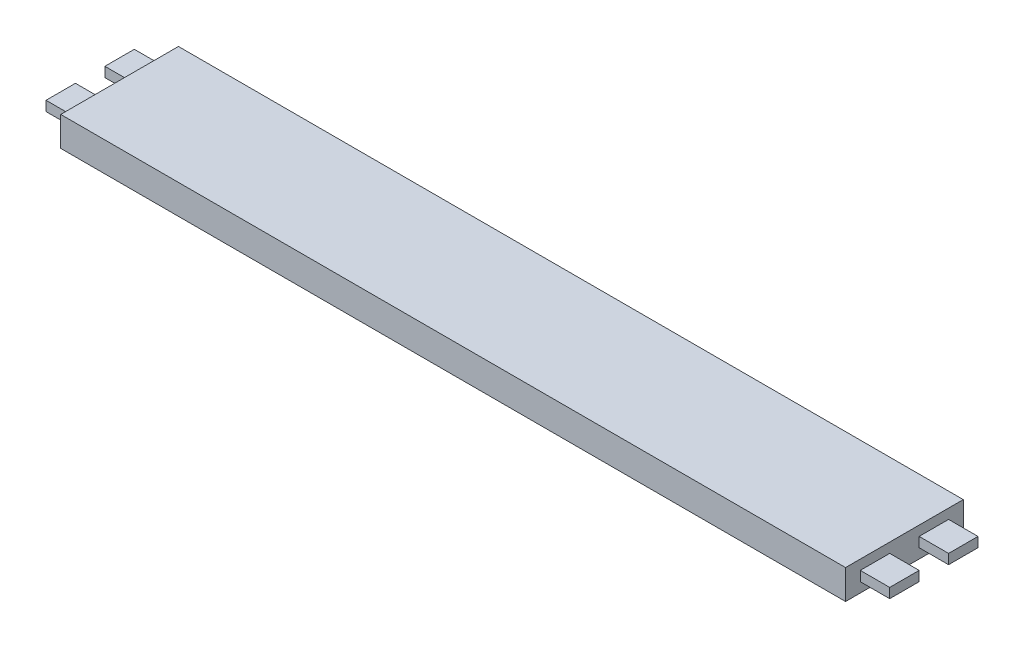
ISO-10303-21;
HEADER;
FILE_DESCRIPTION(('STEP AP214'),'2;1');
FILE_NAME('part.step','',(''),(''),'','','');
FILE_SCHEMA(('AUTOMOTIVE_DESIGN { 1 0 10303 214 1 1 1 1 }'));
ENDSEC;
DATA;
#1=APPLICATION_CONTEXT('core data for automotive mechanical design processes');
#2=APPLICATION_PROTOCOL_DEFINITION('international standard','automotive_design',2000,#1);
#3=PRODUCT_CONTEXT('',#1,'mechanical');
#4=PRODUCT('Part','Part','',(#3));
#5=PRODUCT_RELATED_PRODUCT_CATEGORY('part','',(#4));
#6=PRODUCT_DEFINITION_FORMATION('','',#4);
#7=PRODUCT_DEFINITION_CONTEXT('part definition',#1,'design');
#8=PRODUCT_DEFINITION('design','',#6,#7);
#9=PRODUCT_DEFINITION_SHAPE('','',#8);
#10=(LENGTH_UNIT() NAMED_UNIT(*) SI_UNIT(.MILLI.,.METRE.));
#11=(NAMED_UNIT(*) PLANE_ANGLE_UNIT() SI_UNIT($,.RADIAN.));
#12=(NAMED_UNIT(*) SI_UNIT($,.STERADIAN.) SOLID_ANGLE_UNIT());
#13=UNCERTAINTY_MEASURE_WITH_UNIT(LENGTH_MEASURE(1.E-05),#10,'distance_accuracy_value','');
#14=(GEOMETRIC_REPRESENTATION_CONTEXT(3) GLOBAL_UNCERTAINTY_ASSIGNED_CONTEXT((#13)) GLOBAL_UNIT_ASSIGNED_CONTEXT((#10,
#11,#12)) REPRESENTATION_CONTEXT('',''));
#15=CARTESIAN_POINT('',(0.,0.,0.));
#16=DIRECTION('',(0.,0.,1.));
#17=DIRECTION('',(1.,0.,0.));
#18=AXIS2_PLACEMENT_3D('',#15,#16,#17);
#19=CARTESIAN_POINT('',(200.,15.,0.));
#20=DIRECTION('',(-1.,0.,0.));
#21=DIRECTION('',(0.,0.,1.));
#22=AXIS2_PLACEMENT_3D('',#19,#20,#21);
#23=PLANE('',#22);
#24=DIRECTION('',(0.,-1.,0.));
#25=VECTOR('',#24,1.);
#26=CARTESIAN_POINT('',(200.,10.,-7.5));
#27=LINE('',#26,#25);
#28=CARTESIAN_POINT('',(200.,10.,-7.5));
#29=VERTEX_POINT('',#28);
#30=CARTESIAN_POINT('',(200.,5.00000000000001,-7.5));
#31=VERTEX_POINT('',#30);
#32=EDGE_CURVE('E325',#29,#31,#27,.T.);
#33=ORIENTED_EDGE('',*,*,#32,.F.);
#34=DIRECTION('',(0.,0.,1.));
#35=VECTOR('',#34,1.);
#36=CARTESIAN_POINT('',(200.,10.,-7.5));
#37=LINE('',#36,#35);
#38=CARTESIAN_POINT('',(200.,10.,-22.5));
#39=VERTEX_POINT('',#38);
#40=EDGE_CURVE('E342',#39,#29,#37,.T.);
#41=ORIENTED_EDGE('',*,*,#40,.F.);
#42=DIRECTION('',(0.,1.,0.));
#43=VECTOR('',#42,1.);
#44=CARTESIAN_POINT('',(200.,10.,-22.5));
#45=LINE('',#44,#43);
#46=CARTESIAN_POINT('',(200.,5.00000000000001,-22.5));
#47=VERTEX_POINT('',#46);
#48=EDGE_CURVE('E359',#47,#39,#45,.T.);
#49=ORIENTED_EDGE('',*,*,#48,.F.);
#50=DIRECTION('',(0.,0.,-1.));
#51=VECTOR('',#50,1.);
#52=CARTESIAN_POINT('',(200.,5.00000000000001,-7.5));
#53=LINE('',#52,#51);
#54=EDGE_CURVE('E355',#31,#47,#53,.T.);
#55=ORIENTED_EDGE('',*,*,#54,.F.);
#56=EDGE_LOOP('',(#33,#41,#49,#55));
#57=FACE_BOUND('',#56,.T.);
#58=DIRECTION('',(0.,0.,-1.));
#59=VECTOR('',#58,1.);
#60=CARTESIAN_POINT('',(200.,0.,0.));
#61=LINE('',#60,#59);
#62=CARTESIAN_POINT('',(200.,0.,0.));
#63=VERTEX_POINT('',#62);
#64=CARTESIAN_POINT('',(200.,0.,-60.));
#65=VERTEX_POINT('',#64);
#66=EDGE_CURVE('E394',#63,#65,#61,.T.);
#67=ORIENTED_EDGE('',*,*,#66,.T.);
#68=DIRECTION('',(0.,-1.,0.));
#69=VECTOR('',#68,1.);
#70=CARTESIAN_POINT('',(200.,15.,-60.));
#71=LINE('',#70,#69);
#72=CARTESIAN_POINT('',(200.,15.,-60.));
#73=VERTEX_POINT('',#72);
#74=EDGE_CURVE('E54',#73,#65,#71,.T.);
#75=ORIENTED_EDGE('',*,*,#74,.F.);
#76=DIRECTION('',(0.,0.,-1.));
#77=VECTOR('',#76,1.);
#78=CARTESIAN_POINT('',(200.,15.,0.));
#79=LINE('',#78,#77);
#80=CARTESIAN_POINT('',(200.,15.,0.));
#81=VERTEX_POINT('',#80);
#82=EDGE_CURVE('E385',#81,#73,#79,.T.);
#83=ORIENTED_EDGE('',*,*,#82,.F.);
#84=DIRECTION('',(0.,-1.,0.));
#85=VECTOR('',#84,1.);
#86=CARTESIAN_POINT('',(200.,15.,0.));
#87=LINE('',#86,#85);
#88=EDGE_CURVE('E11',#81,#63,#87,.T.);
#89=ORIENTED_EDGE('',*,*,#88,.T.);
#90=EDGE_LOOP('',(#67,#75,#83,#89));
#91=FACE_BOUND('',#90,.T.);
#92=DIRECTION('',(0.,-1.,0.));
#93=VECTOR('',#92,1.);
#94=CARTESIAN_POINT('',(200.,10.,-37.5));
#95=LINE('',#94,#93);
#96=CARTESIAN_POINT('',(200.,10.,-37.5));
#97=VERTEX_POINT('',#96);
#98=CARTESIAN_POINT('',(200.,5.,-37.5));
#99=VERTEX_POINT('',#98);
#100=EDGE_CURVE('E321',#97,#99,#95,.T.);
#101=ORIENTED_EDGE('',*,*,#100,.F.);
#102=DIRECTION('',(0.,0.,1.));
#103=VECTOR('',#102,1.);
#104=CARTESIAN_POINT('',(200.,10.,-37.5));
#105=LINE('',#104,#103);
#106=CARTESIAN_POINT('',(200.,10.,-52.5));
#107=VERTEX_POINT('',#106);
#108=EDGE_CURVE('E308',#107,#97,#105,.T.);
#109=ORIENTED_EDGE('',*,*,#108,.F.);
#110=DIRECTION('',(0.,1.,0.));
#111=VECTOR('',#110,1.);
#112=CARTESIAN_POINT('',(200.,10.,-52.5));
#113=LINE('',#112,#111);
#114=CARTESIAN_POINT('',(200.,5.,-52.5));
#115=VERTEX_POINT('',#114);
#116=EDGE_CURVE('E312',#115,#107,#113,.T.);
#117=ORIENTED_EDGE('',*,*,#116,.F.);
#118=DIRECTION('',(0.,0.,-1.));
#119=VECTOR('',#118,1.);
#120=CARTESIAN_POINT('',(200.,5.,-37.5));
#121=LINE('',#120,#119);
#122=EDGE_CURVE('E317',#99,#115,#121,.T.);
#123=ORIENTED_EDGE('',*,*,#122,.F.);
#124=EDGE_LOOP('',(#101,#109,#117,#123));
#125=FACE_BOUND('',#124,.T.);
#126=ADVANCED_FACE('F45',(#57,#91,#125),#23,.F.);
#127=CARTESIAN_POINT('',(0.,15.,0.));
#128=DIRECTION('',(0.,0.,-1.));
#129=DIRECTION('',(-1.,0.,0.));
#130=AXIS2_PLACEMENT_3D('',#127,#128,#129);
#131=PLANE('',#130);
#132=DIRECTION('',(1.,0.,0.));
#133=VECTOR('',#132,1.);
#134=CARTESIAN_POINT('',(0.,0.,0.));
#135=LINE('',#134,#133);
#136=CARTESIAN_POINT('',(-200.,0.,0.));
#137=VERTEX_POINT('',#136);
#138=EDGE_CURVE('E381',#137,#63,#135,.T.);
#139=ORIENTED_EDGE('',*,*,#138,.T.);
#140=ORIENTED_EDGE('',*,*,#88,.F.);
#141=DIRECTION('',(1.,0.,0.));
#142=VECTOR('',#141,1.);
#143=CARTESIAN_POINT('',(0.,15.,0.));
#144=LINE('',#143,#142);
#145=CARTESIAN_POINT('',(-200.,15.,0.));
#146=VERTEX_POINT('',#145);
#147=EDGE_CURVE('E382',#146,#81,#144,.T.);
#148=ORIENTED_EDGE('',*,*,#147,.F.);
#149=DIRECTION('',(0.,-1.,0.));
#150=VECTOR('',#149,1.);
#151=CARTESIAN_POINT('',(-200.,15.,0.));
#152=LINE('',#151,#150);
#153=EDGE_CURVE('E280',#146,#137,#152,.T.);
#154=ORIENTED_EDGE('',*,*,#153,.T.);
#155=EDGE_LOOP('',(#139,#140,#148,#154));
#156=FACE_BOUND('',#155,.T.);
#157=ADVANCED_FACE('F47',(#156),#131,.F.);
#158=CARTESIAN_POINT('',(0.,15.,-60.));
#159=DIRECTION('',(0.,0.,1.));
#160=DIRECTION('',(1.,0.,0.));
#161=AXIS2_PLACEMENT_3D('',#158,#159,#160);
#162=PLANE('',#161);
#163=DIRECTION('',(-1.,0.,0.));
#164=VECTOR('',#163,1.);
#165=CARTESIAN_POINT('',(0.,0.,-60.));
#166=LINE('',#165,#164);
#167=CARTESIAN_POINT('',(-200.,0.,-60.));
#168=VERTEX_POINT('',#167);
#169=EDGE_CURVE('E386',#65,#168,#166,.T.);
#170=ORIENTED_EDGE('',*,*,#169,.T.);
#171=DIRECTION('',(0.,-1.,0.));
#172=VECTOR('',#171,1.);
#173=CARTESIAN_POINT('',(-200.,15.,-60.));
#174=LINE('',#173,#172);
#175=CARTESIAN_POINT('',(-200.,15.,-60.));
#176=VERTEX_POINT('',#175);
#177=EDGE_CURVE('E287',#176,#168,#174,.T.);
#178=ORIENTED_EDGE('',*,*,#177,.F.);
#179=DIRECTION('',(-1.,0.,0.));
#180=VECTOR('',#179,1.);
#181=CARTESIAN_POINT('',(0.,15.,-60.));
#182=LINE('',#181,#180);
#183=EDGE_CURVE('E389',#73,#176,#182,.T.);
#184=ORIENTED_EDGE('',*,*,#183,.F.);
#185=ORIENTED_EDGE('',*,*,#74,.T.);
#186=EDGE_LOOP('',(#170,#178,#184,#185));
#187=FACE_BOUND('',#186,.T.);
#188=ADVANCED_FACE('F404',(#187),#162,.F.);
#189=CARTESIAN_POINT('',(0.,15.,0.));
#190=DIRECTION('',(0.,-1.,0.));
#191=DIRECTION('',(0.,0.,-1.));
#192=AXIS2_PLACEMENT_3D('',#189,#190,#191);
#193=PLANE('',#192);
#194=ORIENTED_EDGE('',*,*,#183,.T.);
#195=DIRECTION('',(0.,0.,-1.));
#196=VECTOR('',#195,1.);
#197=CARTESIAN_POINT('',(-200.,15.,0.));
#198=LINE('',#197,#196);
#199=EDGE_CURVE('E276',#146,#176,#198,.T.);
#200=ORIENTED_EDGE('',*,*,#199,.F.);
#201=ORIENTED_EDGE('',*,*,#147,.T.);
#202=ORIENTED_EDGE('',*,*,#82,.T.);
#203=EDGE_LOOP('',(#194,#200,#201,#202));
#204=FACE_BOUND('',#203,.T.);
#205=ADVANCED_FACE('F417',(#204),#193,.F.);
#206=CARTESIAN_POINT('',(0.,0.,0.));
#207=DIRECTION('',(0.,-1.,0.));
#208=DIRECTION('',(0.,0.,-1.));
#209=AXIS2_PLACEMENT_3D('',#206,#207,#208);
#210=PLANE('',#209);
#211=ORIENTED_EDGE('',*,*,#138,.F.);
#212=DIRECTION('',(0.,0.,-1.));
#213=VECTOR('',#212,1.);
#214=CARTESIAN_POINT('',(-200.,0.,0.));
#215=LINE('',#214,#213);
#216=EDGE_CURVE('E275',#137,#168,#215,.T.);
#217=ORIENTED_EDGE('',*,*,#216,.T.);
#218=ORIENTED_EDGE('',*,*,#169,.F.);
#219=ORIENTED_EDGE('',*,*,#66,.F.);
#220=EDGE_LOOP('',(#211,#217,#218,#219));
#221=FACE_BOUND('',#220,.T.);
#222=ADVANCED_FACE('F410',(#221),#210,.T.);
#223=CARTESIAN_POINT('',(215.,10.,-7.5));
#224=DIRECTION('',(0.,0.,-1.));
#225=DIRECTION('',(0.,1.,0.));
#226=AXIS2_PLACEMENT_3D('',#223,#224,#225);
#227=PLANE('',#226);
#228=ORIENTED_EDGE('',*,*,#32,.T.);
#229=DIRECTION('',(-1.,0.,0.));
#230=VECTOR('',#229,1.);
#231=CARTESIAN_POINT('',(215.,5.00000000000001,-7.5));
#232=LINE('',#231,#230);
#233=CARTESIAN_POINT('',(215.,5.00000000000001,-7.5));
#234=VERTEX_POINT('',#233);
#235=EDGE_CURVE('E377',#234,#31,#232,.T.);
#236=ORIENTED_EDGE('',*,*,#235,.F.);
#237=DIRECTION('',(0.,-1.,0.));
#238=VECTOR('',#237,1.);
#239=CARTESIAN_POINT('',(215.,10.,-7.5));
#240=LINE('',#239,#238);
#241=CARTESIAN_POINT('',(215.,10.,-7.5));
#242=VERTEX_POINT('',#241);
#243=EDGE_CURVE('E337',#242,#234,#240,.T.);
#244=ORIENTED_EDGE('',*,*,#243,.F.);
#245=DIRECTION('',(-1.,0.,0.));
#246=VECTOR('',#245,1.);
#247=CARTESIAN_POINT('',(215.,10.,-7.5));
#248=LINE('',#247,#246);
#249=EDGE_CURVE('E351',#242,#29,#248,.T.);
#250=ORIENTED_EDGE('',*,*,#249,.T.);
#251=EDGE_LOOP('',(#228,#236,#244,#250));
#252=FACE_BOUND('',#251,.T.);
#253=ADVANCED_FACE('F435',(#252),#227,.F.);
#254=CARTESIAN_POINT('',(215.,5.00000000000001,-7.5));
#255=DIRECTION('',(0.,1.,0.));
#256=DIRECTION('',(0.,0.,1.));
#257=AXIS2_PLACEMENT_3D('',#254,#255,#256);
#258=PLANE('',#257);
#259=ORIENTED_EDGE('',*,*,#54,.T.);
#260=DIRECTION('',(-1.,0.,0.));
#261=VECTOR('',#260,1.);
#262=CARTESIAN_POINT('',(215.,5.00000000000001,-22.5));
#263=LINE('',#262,#261);
#264=CARTESIAN_POINT('',(215.,5.00000000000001,-22.5));
#265=VERTEX_POINT('',#264);
#266=EDGE_CURVE('E373',#265,#47,#263,.T.);
#267=ORIENTED_EDGE('',*,*,#266,.F.);
#268=DIRECTION('',(0.,0.,-1.));
#269=VECTOR('',#268,1.);
#270=CARTESIAN_POINT('',(215.,5.00000000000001,-7.5));
#271=LINE('',#270,#269);
#272=EDGE_CURVE('E341',#234,#265,#271,.T.);
#273=ORIENTED_EDGE('',*,*,#272,.F.);
#274=ORIENTED_EDGE('',*,*,#235,.T.);
#275=EDGE_LOOP('',(#259,#267,#273,#274));
#276=FACE_BOUND('',#275,.T.);
#277=ADVANCED_FACE('F439',(#276),#258,.F.);
#278=CARTESIAN_POINT('',(215.,10.,-22.5));
#279=DIRECTION('',(0.,0.,1.));
#280=DIRECTION('',(1.,0.,0.));
#281=AXIS2_PLACEMENT_3D('',#278,#279,#280);
#282=PLANE('',#281);
#283=ORIENTED_EDGE('',*,*,#48,.T.);
#284=DIRECTION('',(-1.,0.,0.));
#285=VECTOR('',#284,1.);
#286=CARTESIAN_POINT('',(215.,10.,-22.5));
#287=LINE('',#286,#285);
#288=CARTESIAN_POINT('',(215.,10.,-22.5));
#289=VERTEX_POINT('',#288);
#290=EDGE_CURVE('E369',#289,#39,#287,.T.);
#291=ORIENTED_EDGE('',*,*,#290,.F.);
#292=DIRECTION('',(0.,1.,0.));
#293=VECTOR('',#292,1.);
#294=CARTESIAN_POINT('',(215.,10.,-22.5));
#295=LINE('',#294,#293);
#296=EDGE_CURVE('E345',#265,#289,#295,.T.);
#297=ORIENTED_EDGE('',*,*,#296,.F.);
#298=ORIENTED_EDGE('',*,*,#266,.T.);
#299=EDGE_LOOP('',(#283,#291,#297,#298));
#300=FACE_BOUND('',#299,.T.);
#301=ADVANCED_FACE('F443',(#300),#282,.F.);
#302=CARTESIAN_POINT('',(215.,10.,-7.5));
#303=DIRECTION('',(0.,-1.,0.));
#304=DIRECTION('',(0.,0.,-1.));
#305=AXIS2_PLACEMENT_3D('',#302,#303,#304);
#306=PLANE('',#305);
#307=ORIENTED_EDGE('',*,*,#40,.T.);
#308=ORIENTED_EDGE('',*,*,#249,.F.);
#309=DIRECTION('',(0.,0.,1.));
#310=VECTOR('',#309,1.);
#311=CARTESIAN_POINT('',(215.,10.,-7.5));
#312=LINE('',#311,#310);
#313=EDGE_CURVE('E348',#289,#242,#312,.T.);
#314=ORIENTED_EDGE('',*,*,#313,.F.);
#315=ORIENTED_EDGE('',*,*,#290,.T.);
#316=EDGE_LOOP('',(#307,#308,#314,#315));
#317=FACE_BOUND('',#316,.T.);
#318=ADVANCED_FACE('F447',(#317),#306,.F.);
#319=CARTESIAN_POINT('',(215.,0.,0.));
#320=DIRECTION('',(1.,0.,0.));
#321=DIRECTION('',(0.,0.,-1.));
#322=AXIS2_PLACEMENT_3D('',#319,#320,#321);
#323=PLANE('',#322);
#324=ORIENTED_EDGE('',*,*,#243,.T.);
#325=ORIENTED_EDGE('',*,*,#272,.T.);
#326=ORIENTED_EDGE('',*,*,#296,.T.);
#327=ORIENTED_EDGE('',*,*,#313,.T.);
#328=EDGE_LOOP('',(#324,#325,#326,#327));
#329=FACE_BOUND('',#328,.T.);
#330=ADVANCED_FACE('F451',(#329),#323,.T.);
#331=CARTESIAN_POINT('',(215.,10.,-37.5));
#332=DIRECTION('',(0.,0.,-1.));
#333=DIRECTION('',(-1.,0.,0.));
#334=AXIS2_PLACEMENT_3D('',#331,#332,#333);
#335=PLANE('',#334);
#336=ORIENTED_EDGE('',*,*,#100,.T.);
#337=DIRECTION('',(-1.,0.,0.));
#338=VECTOR('',#337,1.);
#339=CARTESIAN_POINT('',(215.,5.,-37.5));
#340=LINE('',#339,#338);
#341=CARTESIAN_POINT('',(215.,5.,-37.5));
#342=VERTEX_POINT('',#341);
#343=EDGE_CURVE('E291',#342,#99,#340,.T.);
#344=ORIENTED_EDGE('',*,*,#343,.F.);
#345=DIRECTION('',(0.,-1.,0.));
#346=VECTOR('',#345,1.);
#347=CARTESIAN_POINT('',(215.,10.,-37.5));
#348=LINE('',#347,#346);
#349=CARTESIAN_POINT('',(215.,10.,-37.5));
#350=VERTEX_POINT('',#349);
#351=EDGE_CURVE('E313',#350,#342,#348,.T.);
#352=ORIENTED_EDGE('',*,*,#351,.F.);
#353=DIRECTION('',(-1.,0.,0.));
#354=VECTOR('',#353,1.);
#355=CARTESIAN_POINT('',(215.,10.,-37.5));
#356=LINE('',#355,#354);
#357=EDGE_CURVE('E303',#350,#97,#356,.T.);
#358=ORIENTED_EDGE('',*,*,#357,.T.);
#359=EDGE_LOOP('',(#336,#344,#352,#358));
#360=FACE_BOUND('',#359,.T.);
#361=ADVANCED_FACE('F455',(#360),#335,.F.);
#362=CARTESIAN_POINT('',(215.,5.,-37.5));
#363=DIRECTION('',(0.,1.,0.));
#364=DIRECTION('',(0.,0.,1.));
#365=AXIS2_PLACEMENT_3D('',#362,#363,#364);
#366=PLANE('',#365);
#367=ORIENTED_EDGE('',*,*,#122,.T.);
#368=DIRECTION('',(-1.,0.,0.));
#369=VECTOR('',#368,1.);
#370=CARTESIAN_POINT('',(215.,5.,-52.5));
#371=LINE('',#370,#369);
#372=CARTESIAN_POINT('',(215.,5.,-52.5));
#373=VERTEX_POINT('',#372);
#374=EDGE_CURVE('E295',#373,#115,#371,.T.);
#375=ORIENTED_EDGE('',*,*,#374,.F.);
#376=DIRECTION('',(0.,0.,-1.));
#377=VECTOR('',#376,1.);
#378=CARTESIAN_POINT('',(215.,5.,-37.5));
#379=LINE('',#378,#377);
#380=EDGE_CURVE('E331',#342,#373,#379,.T.);
#381=ORIENTED_EDGE('',*,*,#380,.F.);
#382=ORIENTED_EDGE('',*,*,#343,.T.);
#383=EDGE_LOOP('',(#367,#375,#381,#382));
#384=FACE_BOUND('',#383,.T.);
#385=ADVANCED_FACE('F467',(#384),#366,.F.);
#386=CARTESIAN_POINT('',(215.,10.,-52.5));
#387=DIRECTION('',(0.,0.,1.));
#388=DIRECTION('',(1.,0.,0.));
#389=AXIS2_PLACEMENT_3D('',#386,#387,#388);
#390=PLANE('',#389);
#391=ORIENTED_EDGE('',*,*,#116,.T.);
#392=DIRECTION('',(-1.,0.,0.));
#393=VECTOR('',#392,1.);
#394=CARTESIAN_POINT('',(215.,10.,-52.5));
#395=LINE('',#394,#393);
#396=CARTESIAN_POINT('',(215.,10.,-52.5));
#397=VERTEX_POINT('',#396);
#398=EDGE_CURVE('E299',#397,#107,#395,.T.);
#399=ORIENTED_EDGE('',*,*,#398,.F.);
#400=DIRECTION('',(0.,1.,0.));
#401=VECTOR('',#400,1.);
#402=CARTESIAN_POINT('',(215.,10.,-52.5));
#403=LINE('',#402,#401);
#404=EDGE_CURVE('E328',#373,#397,#403,.T.);
#405=ORIENTED_EDGE('',*,*,#404,.F.);
#406=ORIENTED_EDGE('',*,*,#374,.T.);
#407=EDGE_LOOP('',(#391,#399,#405,#406));
#408=FACE_BOUND('',#407,.T.);
#409=ADVANCED_FACE('F463',(#408),#390,.F.);
#410=CARTESIAN_POINT('',(215.,10.,-37.5));
#411=DIRECTION('',(0.,-1.,0.));
#412=DIRECTION('',(0.,0.,-1.));
#413=AXIS2_PLACEMENT_3D('',#410,#411,#412);
#414=PLANE('',#413);
#415=ORIENTED_EDGE('',*,*,#108,.T.);
#416=ORIENTED_EDGE('',*,*,#357,.F.);
#417=DIRECTION('',(0.,0.,1.));
#418=VECTOR('',#417,1.);
#419=CARTESIAN_POINT('',(215.,10.,-37.5));
#420=LINE('',#419,#418);
#421=EDGE_CURVE('E307',#397,#350,#420,.T.);
#422=ORIENTED_EDGE('',*,*,#421,.F.);
#423=ORIENTED_EDGE('',*,*,#398,.T.);
#424=EDGE_LOOP('',(#415,#416,#422,#423));
#425=FACE_BOUND('',#424,.T.);
#426=ADVANCED_FACE('F459',(#425),#414,.F.);
#427=CARTESIAN_POINT('',(215.,0.,0.));
#428=DIRECTION('',(1.,0.,0.));
#429=DIRECTION('',(0.,0.,-1.));
#430=AXIS2_PLACEMENT_3D('',#427,#428,#429);
#431=PLANE('',#430);
#432=ORIENTED_EDGE('',*,*,#351,.T.);
#433=ORIENTED_EDGE('',*,*,#380,.T.);
#434=ORIENTED_EDGE('',*,*,#404,.T.);
#435=ORIENTED_EDGE('',*,*,#421,.T.);
#436=EDGE_LOOP('',(#432,#433,#434,#435));
#437=FACE_BOUND('',#436,.T.);
#438=ADVANCED_FACE('F457',(#437),#431,.T.);
#439=CARTESIAN_POINT('',(-200.,15.,0.));
#440=DIRECTION('',(-1.,0.,0.));
#441=DIRECTION('',(0.,0.,1.));
#442=AXIS2_PLACEMENT_3D('',#439,#440,#441);
#443=PLANE('',#442);
#444=DIRECTION('',(0.,-1.,0.));
#445=VECTOR('',#444,1.);
#446=CARTESIAN_POINT('',(-200.,10.,-37.5));
#447=LINE('',#446,#445);
#448=CARTESIAN_POINT('',(-200.,10.,-37.5));
#449=VERTEX_POINT('',#448);
#450=CARTESIAN_POINT('',(-200.,5.,-37.5));
#451=VERTEX_POINT('',#450);
#452=EDGE_CURVE('E188',#449,#451,#447,.T.);
#453=ORIENTED_EDGE('',*,*,#452,.T.);
#454=DIRECTION('',(0.,0.,-1.));
#455=VECTOR('',#454,1.);
#456=CARTESIAN_POINT('',(-200.,5.,-37.5));
#457=LINE('',#456,#455);
#458=CARTESIAN_POINT('',(-200.,5.,-52.5));
#459=VERTEX_POINT('',#458);
#460=EDGE_CURVE('E204',#451,#459,#457,.T.);
#461=ORIENTED_EDGE('',*,*,#460,.T.);
#462=DIRECTION('',(0.,1.,0.));
#463=VECTOR('',#462,1.);
#464=CARTESIAN_POINT('',(-200.,10.,-52.5));
#465=LINE('',#464,#463);
#466=CARTESIAN_POINT('',(-200.,10.,-52.5));
#467=VERTEX_POINT('',#466);
#468=EDGE_CURVE('E66',#459,#467,#465,.T.);
#469=ORIENTED_EDGE('',*,*,#468,.T.);
#470=DIRECTION('',(0.,0.,1.));
#471=VECTOR('',#470,1.);
#472=CARTESIAN_POINT('',(-200.,10.,-37.5));
#473=LINE('',#472,#471);
#474=EDGE_CURVE('E61',#467,#449,#473,.T.);
#475=ORIENTED_EDGE('',*,*,#474,.T.);
#476=EDGE_LOOP('',(#453,#461,#469,#475));
#477=FACE_BOUND('',#476,.T.);
#478=DIRECTION('',(0.,-1.,0.));
#479=VECTOR('',#478,1.);
#480=CARTESIAN_POINT('',(-200.,10.,-7.5));
#481=LINE('',#480,#479);
#482=CARTESIAN_POINT('',(-200.,10.,-7.5));
#483=VERTEX_POINT('',#482);
#484=CARTESIAN_POINT('',(-200.,5.00000000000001,-7.5));
#485=VERTEX_POINT('',#484);
#486=EDGE_CURVE('E192',#483,#485,#481,.T.);
#487=ORIENTED_EDGE('',*,*,#486,.T.);
#488=DIRECTION('',(0.,0.,-1.));
#489=VECTOR('',#488,1.);
#490=CARTESIAN_POINT('',(-200.,5.00000000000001,-7.5));
#491=LINE('',#490,#489);
#492=CARTESIAN_POINT('',(-200.,5.00000000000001,-22.5));
#493=VERTEX_POINT('',#492);
#494=EDGE_CURVE('E237',#485,#493,#491,.T.);
#495=ORIENTED_EDGE('',*,*,#494,.T.);
#496=DIRECTION('',(0.,1.,0.));
#497=VECTOR('',#496,1.);
#498=CARTESIAN_POINT('',(-200.,10.,-22.5));
#499=LINE('',#498,#497);
#500=CARTESIAN_POINT('',(-200.,10.,-22.5));
#501=VERTEX_POINT('',#500);
#502=EDGE_CURVE('E255',#493,#501,#499,.T.);
#503=ORIENTED_EDGE('',*,*,#502,.T.);
#504=DIRECTION('',(0.,0.,1.));
#505=VECTOR('',#504,1.);
#506=CARTESIAN_POINT('',(-200.,10.,-7.5));
#507=LINE('',#506,#505);
#508=EDGE_CURVE('E252',#501,#483,#507,.T.);
#509=ORIENTED_EDGE('',*,*,#508,.T.);
#510=EDGE_LOOP('',(#487,#495,#503,#509));
#511=FACE_BOUND('',#510,.T.);
#512=ORIENTED_EDGE('',*,*,#216,.F.);
#513=ORIENTED_EDGE('',*,*,#153,.F.);
#514=ORIENTED_EDGE('',*,*,#199,.T.);
#515=ORIENTED_EDGE('',*,*,#177,.T.);
#516=EDGE_LOOP('',(#512,#513,#514,#515));
#517=FACE_BOUND('',#516,.T.);
#518=ADVANCED_FACE('F414',(#477,#511,#517),#443,.T.);
#519=CARTESIAN_POINT('',(-215.,10.,-7.5));
#520=DIRECTION('',(0.,0.,1.));
#521=DIRECTION('',(0.,-1.,0.));
#522=AXIS2_PLACEMENT_3D('',#519,#520,#521);
#523=PLANE('',#522);
#524=ORIENTED_EDGE('',*,*,#486,.F.);
#525=DIRECTION('',(1.,0.,0.));
#526=VECTOR('',#525,1.);
#527=CARTESIAN_POINT('',(-215.,10.,-7.5));
#528=LINE('',#527,#526);
#529=CARTESIAN_POINT('',(-215.,10.,-7.5));
#530=VERTEX_POINT('',#529);
#531=EDGE_CURVE('E271',#530,#483,#528,.T.);
#532=ORIENTED_EDGE('',*,*,#531,.F.);
#533=DIRECTION('',(0.,-1.,0.));
#534=VECTOR('',#533,1.);
#535=CARTESIAN_POINT('',(-215.,10.,-7.5));
#536=LINE('',#535,#534);
#537=CARTESIAN_POINT('',(-215.,5.00000000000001,-7.5));
#538=VERTEX_POINT('',#537);
#539=EDGE_CURVE('E232',#530,#538,#536,.T.);
#540=ORIENTED_EDGE('',*,*,#539,.T.);
#541=DIRECTION('',(1.,0.,0.));
#542=VECTOR('',#541,1.);
#543=CARTESIAN_POINT('',(-215.,5.00000000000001,-7.5));
#544=LINE('',#543,#542);
#545=EDGE_CURVE('E249',#538,#485,#544,.T.);
#546=ORIENTED_EDGE('',*,*,#545,.T.);
#547=EDGE_LOOP('',(#524,#532,#540,#546));
#548=FACE_BOUND('',#547,.T.);
#549=ADVANCED_FACE('F477',(#548),#523,.T.);
#550=CARTESIAN_POINT('',(-215.,10.,-7.5));
#551=DIRECTION('',(0.,1.,0.));
#552=DIRECTION('',(0.,0.,1.));
#553=AXIS2_PLACEMENT_3D('',#550,#551,#552);
#554=PLANE('',#553);
#555=ORIENTED_EDGE('',*,*,#508,.F.);
#556=DIRECTION('',(1.,0.,0.));
#557=VECTOR('',#556,1.);
#558=CARTESIAN_POINT('',(-215.,10.,-22.5));
#559=LINE('',#558,#557);
#560=CARTESIAN_POINT('',(-215.,10.,-22.5));
#561=VERTEX_POINT('',#560);
#562=EDGE_CURVE('E267',#561,#501,#559,.T.);
#563=ORIENTED_EDGE('',*,*,#562,.F.);
#564=DIRECTION('',(0.,0.,1.));
#565=VECTOR('',#564,1.);
#566=CARTESIAN_POINT('',(-215.,10.,-7.5));
#567=LINE('',#566,#565);
#568=EDGE_CURVE('E236',#561,#530,#567,.T.);
#569=ORIENTED_EDGE('',*,*,#568,.T.);
#570=ORIENTED_EDGE('',*,*,#531,.T.);
#571=EDGE_LOOP('',(#555,#563,#569,#570));
#572=FACE_BOUND('',#571,.T.);
#573=ADVANCED_FACE('F480',(#572),#554,.T.);
#574=CARTESIAN_POINT('',(-215.,10.,-22.5));
#575=DIRECTION('',(0.,0.,-1.));
#576=DIRECTION('',(-1.,0.,0.));
#577=AXIS2_PLACEMENT_3D('',#574,#575,#576);
#578=PLANE('',#577);
#579=ORIENTED_EDGE('',*,*,#502,.F.);
#580=DIRECTION('',(1.,0.,0.));
#581=VECTOR('',#580,1.);
#582=CARTESIAN_POINT('',(-215.,5.00000000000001,-22.5));
#583=LINE('',#582,#581);
#584=CARTESIAN_POINT('',(-215.,5.00000000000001,-22.5));
#585=VERTEX_POINT('',#584);
#586=EDGE_CURVE('E263',#585,#493,#583,.T.);
#587=ORIENTED_EDGE('',*,*,#586,.F.);
#588=DIRECTION('',(0.,1.,0.));
#589=VECTOR('',#588,1.);
#590=CARTESIAN_POINT('',(-215.,10.,-22.5));
#591=LINE('',#590,#589);
#592=EDGE_CURVE('E241',#585,#561,#591,.T.);
#593=ORIENTED_EDGE('',*,*,#592,.T.);
#594=ORIENTED_EDGE('',*,*,#562,.T.);
#595=EDGE_LOOP('',(#579,#587,#593,#594));
#596=FACE_BOUND('',#595,.T.);
#597=ADVANCED_FACE('F484',(#596),#578,.T.);
#598=CARTESIAN_POINT('',(-215.,5.00000000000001,-7.5));
#599=DIRECTION('',(0.,-1.,0.));
#600=DIRECTION('',(0.,0.,-1.));
#601=AXIS2_PLACEMENT_3D('',#598,#599,#600);
#602=PLANE('',#601);
#603=ORIENTED_EDGE('',*,*,#494,.F.);
#604=ORIENTED_EDGE('',*,*,#545,.F.);
#605=DIRECTION('',(0.,0.,-1.));
#606=VECTOR('',#605,1.);
#607=CARTESIAN_POINT('',(-215.,5.00000000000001,-7.5));
#608=LINE('',#607,#606);
#609=EDGE_CURVE('E245',#538,#585,#608,.T.);
#610=ORIENTED_EDGE('',*,*,#609,.T.);
#611=ORIENTED_EDGE('',*,*,#586,.T.);
#612=EDGE_LOOP('',(#603,#604,#610,#611));
#613=FACE_BOUND('',#612,.T.);
#614=ADVANCED_FACE('F488',(#613),#602,.T.);
#615=CARTESIAN_POINT('',(-215.,0.,0.));
#616=DIRECTION('',(-1.,0.,0.));
#617=DIRECTION('',(0.,0.,-1.));
#618=AXIS2_PLACEMENT_3D('',#615,#616,#617);
#619=PLANE('',#618);
#620=ORIENTED_EDGE('',*,*,#539,.F.);
#621=ORIENTED_EDGE('',*,*,#568,.F.);
#622=ORIENTED_EDGE('',*,*,#592,.F.);
#623=ORIENTED_EDGE('',*,*,#609,.F.);
#624=EDGE_LOOP('',(#620,#621,#622,#623));
#625=FACE_BOUND('',#624,.T.);
#626=ADVANCED_FACE('F492',(#625),#619,.T.);
#627=CARTESIAN_POINT('',(-215.,10.,-37.5));
#628=DIRECTION('',(0.,0.,1.));
#629=DIRECTION('',(1.,0.,0.));
#630=AXIS2_PLACEMENT_3D('',#627,#628,#629);
#631=PLANE('',#630);
#632=ORIENTED_EDGE('',*,*,#452,.F.);
#633=DIRECTION('',(1.,0.,0.));
#634=VECTOR('',#633,1.);
#635=CARTESIAN_POINT('',(-215.,10.,-37.5));
#636=LINE('',#635,#634);
#637=CARTESIAN_POINT('',(-215.,10.,-37.5));
#638=VERTEX_POINT('',#637);
#639=EDGE_CURVE('E182',#638,#449,#636,.T.);
#640=ORIENTED_EDGE('',*,*,#639,.F.);
#641=DIRECTION('',(0.,-1.,0.));
#642=VECTOR('',#641,1.);
#643=CARTESIAN_POINT('',(-215.,10.,-37.5));
#644=LINE('',#643,#642);
#645=CARTESIAN_POINT('',(-215.,5.,-37.5));
#646=VERTEX_POINT('',#645);
#647=EDGE_CURVE('E186',#638,#646,#644,.T.);
#648=ORIENTED_EDGE('',*,*,#647,.T.);
#649=DIRECTION('',(1.,0.,0.));
#650=VECTOR('',#649,1.);
#651=CARTESIAN_POINT('',(-215.,5.,-37.5));
#652=LINE('',#651,#650);
#653=EDGE_CURVE('E215',#646,#451,#652,.T.);
#654=ORIENTED_EDGE('',*,*,#653,.T.);
#655=EDGE_LOOP('',(#632,#640,#648,#654));
#656=FACE_BOUND('',#655,.T.);
#657=ADVANCED_FACE('F184',(#656),#631,.T.);
#658=CARTESIAN_POINT('',(-215.,10.,-37.5));
#659=DIRECTION('',(0.,1.,0.));
#660=DIRECTION('',(0.,0.,1.));
#661=AXIS2_PLACEMENT_3D('',#658,#659,#660);
#662=PLANE('',#661);
#663=ORIENTED_EDGE('',*,*,#474,.F.);
#664=DIRECTION('',(1.,0.,0.));
#665=VECTOR('',#664,1.);
#666=CARTESIAN_POINT('',(-215.,10.,-52.5));
#667=LINE('',#666,#665);
#668=CARTESIAN_POINT('',(-215.,10.,-52.5));
#669=VERTEX_POINT('',#668);
#670=EDGE_CURVE('E193',#669,#467,#667,.T.);
#671=ORIENTED_EDGE('',*,*,#670,.F.);
#672=DIRECTION('',(0.,0.,1.));
#673=VECTOR('',#672,1.);
#674=CARTESIAN_POINT('',(-215.,10.,-37.5));
#675=LINE('',#674,#673);
#676=EDGE_CURVE('E199',#669,#638,#675,.T.);
#677=ORIENTED_EDGE('',*,*,#676,.T.);
#678=ORIENTED_EDGE('',*,*,#639,.T.);
#679=EDGE_LOOP('',(#663,#671,#677,#678));
#680=FACE_BOUND('',#679,.T.);
#681=ADVANCED_FACE('F206',(#680),#662,.T.);
#682=CARTESIAN_POINT('',(-215.,10.,-52.5));
#683=DIRECTION('',(0.,0.,-1.));
#684=DIRECTION('',(-1.,0.,0.));
#685=AXIS2_PLACEMENT_3D('',#682,#683,#684);
#686=PLANE('',#685);
#687=ORIENTED_EDGE('',*,*,#468,.F.);
#688=DIRECTION('',(1.,0.,0.));
#689=VECTOR('',#688,1.);
#690=CARTESIAN_POINT('',(-215.,5.,-52.5));
#691=LINE('',#690,#689);
#692=CARTESIAN_POINT('',(-215.,5.,-52.5));
#693=VERTEX_POINT('',#692);
#694=EDGE_CURVE('E226',#693,#459,#691,.T.);
#695=ORIENTED_EDGE('',*,*,#694,.F.);
#696=DIRECTION('',(0.,1.,0.));
#697=VECTOR('',#696,1.);
#698=CARTESIAN_POINT('',(-215.,10.,-52.5));
#699=LINE('',#698,#697);
#700=EDGE_CURVE('E208',#693,#669,#699,.T.);
#701=ORIENTED_EDGE('',*,*,#700,.T.);
#702=ORIENTED_EDGE('',*,*,#670,.T.);
#703=EDGE_LOOP('',(#687,#695,#701,#702));
#704=FACE_BOUND('',#703,.T.);
#705=ADVANCED_FACE('F501',(#704),#686,.T.);
#706=CARTESIAN_POINT('',(-215.,5.,-37.5));
#707=DIRECTION('',(0.,-1.,0.));
#708=DIRECTION('',(0.,0.,-1.));
#709=AXIS2_PLACEMENT_3D('',#706,#707,#708);
#710=PLANE('',#709);
#711=ORIENTED_EDGE('',*,*,#460,.F.);
#712=ORIENTED_EDGE('',*,*,#653,.F.);
#713=DIRECTION('',(0.,0.,-1.));
#714=VECTOR('',#713,1.);
#715=CARTESIAN_POINT('',(-215.,5.,-37.5));
#716=LINE('',#715,#714);
#717=EDGE_CURVE('E202',#646,#693,#716,.T.);
#718=ORIENTED_EDGE('',*,*,#717,.T.);
#719=ORIENTED_EDGE('',*,*,#694,.T.);
#720=EDGE_LOOP('',(#711,#712,#718,#719));
#721=FACE_BOUND('',#720,.T.);
#722=ADVANCED_FACE('F504',(#721),#710,.T.);
#723=CARTESIAN_POINT('',(-215.,0.,0.));
#724=DIRECTION('',(-1.,0.,0.));
#725=DIRECTION('',(0.,0.,-1.));
#726=AXIS2_PLACEMENT_3D('',#723,#724,#725);
#727=PLANE('',#726);
#728=ORIENTED_EDGE('',*,*,#647,.F.);
#729=ORIENTED_EDGE('',*,*,#676,.F.);
#730=ORIENTED_EDGE('',*,*,#700,.F.);
#731=ORIENTED_EDGE('',*,*,#717,.F.);
#732=EDGE_LOOP('',(#728,#729,#730,#731));
#733=FACE_BOUND('',#732,.T.);
#734=ADVANCED_FACE('F197',(#733),#727,.T.);
#735=CLOSED_SHELL('',(#126,#157,#188,#205,#222,#253,#277,#301,#318,#330,#361,#385,#409,#426,
#438,#518,#549,#573,#597,#614,#626,#657,#681,#705,#722,#734));
#736=MANIFOLD_SOLID_BREP('B2',#735);
#737=ADVANCED_BREP_SHAPE_REPRESENTATION('',(#18,#736),#14);
#738=SHAPE_DEFINITION_REPRESENTATION(#9,#737);
ENDSEC;
END-ISO-10303-21;
